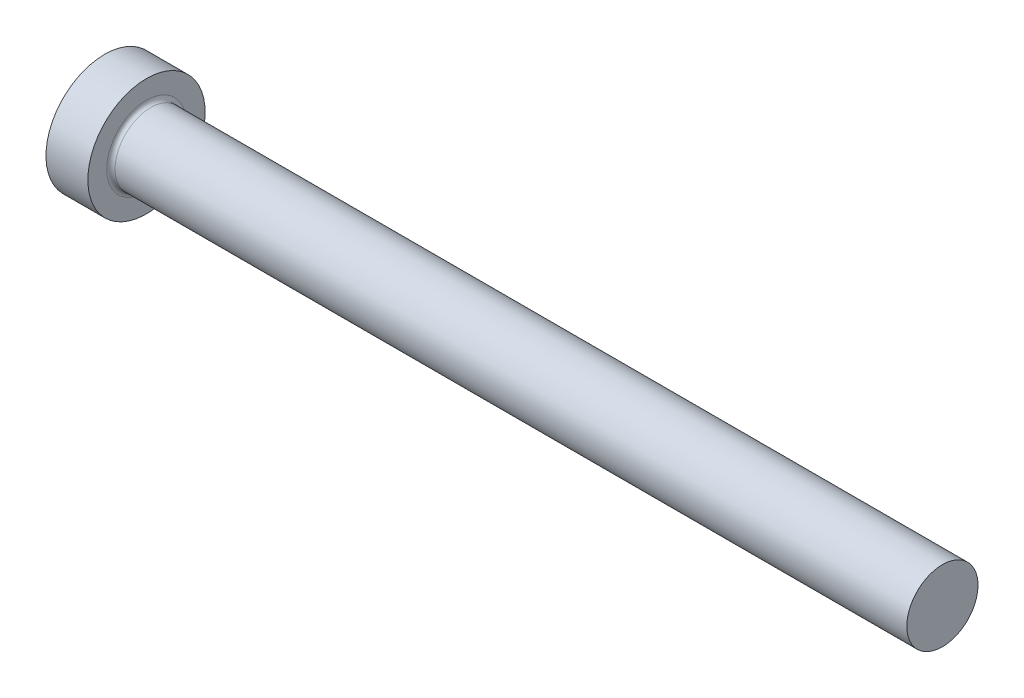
ISO-10303-21;
HEADER;
FILE_DESCRIPTION(('STEP AP214'),'2;1');
FILE_NAME('part.step','',(''),(''),'','','');
FILE_SCHEMA(('AUTOMOTIVE_DESIGN { 1 0 10303 214 1 1 1 1 }'));
ENDSEC;
DATA;
#1=APPLICATION_CONTEXT('core data for automotive mechanical design processes');
#2=APPLICATION_PROTOCOL_DEFINITION('international standard','automotive_design',2000,#1);
#3=PRODUCT_CONTEXT('',#1,'mechanical');
#4=PRODUCT('Part','Part','',(#3));
#5=PRODUCT_RELATED_PRODUCT_CATEGORY('part','',(#4));
#6=PRODUCT_DEFINITION_FORMATION('','',#4);
#7=PRODUCT_DEFINITION_CONTEXT('part definition',#1,'design');
#8=PRODUCT_DEFINITION('design','',#6,#7);
#9=PRODUCT_DEFINITION_SHAPE('','',#8);
#10=(LENGTH_UNIT() NAMED_UNIT(*) SI_UNIT(.MILLI.,.METRE.));
#11=(NAMED_UNIT(*) PLANE_ANGLE_UNIT() SI_UNIT($,.RADIAN.));
#12=(NAMED_UNIT(*) SI_UNIT($,.STERADIAN.) SOLID_ANGLE_UNIT());
#13=UNCERTAINTY_MEASURE_WITH_UNIT(LENGTH_MEASURE(1.E-05),#10,'distance_accuracy_value','');
#14=(GEOMETRIC_REPRESENTATION_CONTEXT(3) GLOBAL_UNCERTAINTY_ASSIGNED_CONTEXT((#13)) GLOBAL_UNIT_ASSIGNED_CONTEXT((#10,
#11,#12)) REPRESENTATION_CONTEXT('',''));
#15=CARTESIAN_POINT('',(0.,0.,0.));
#16=DIRECTION('',(0.,0.,1.));
#17=DIRECTION('',(1.,0.,0.));
#18=AXIS2_PLACEMENT_3D('',#15,#16,#17);
#19=CARTESIAN_POINT('',(0.,0.,0.));
#20=DIRECTION('',(-1.,0.,0.));
#21=DIRECTION('',(0.,-1.,0.));
#22=AXIS2_PLACEMENT_3D('',#19,#20,#21);
#23=PLANE('',#22);
#24=CARTESIAN_POINT('',(0.,0.,0.));
#25=DIRECTION('',(1.,0.,0.));
#26=DIRECTION('',(0.,1.,0.));
#27=AXIS2_PLACEMENT_3D('',#24,#25,#26);
#28=CIRCLE('',#27,7.);
#29=CARTESIAN_POINT('',(0.,7.,0.));
#30=VERTEX_POINT('',#29);
#31=EDGE_CURVE('E25',#30,#30,#28,.T.);
#32=ORIENTED_EDGE('',*,*,#31,.F.);
#33=EDGE_LOOP('',(#32));
#34=FACE_BOUND('',#33,.T.);
#35=ADVANCED_FACE('F14',(#34),#23,.T.);
#36=CARTESIAN_POINT('',(100.,0.,0.));
#37=DIRECTION('',(1.,0.,0.));
#38=DIRECTION('',(0.,1.,0.));
#39=AXIS2_PLACEMENT_3D('',#36,#37,#38);
#40=CYLINDRICAL_SURFACE('',#39,7.);
#41=ORIENTED_EDGE('',*,*,#31,.T.);
#42=EDGE_LOOP('',(#41));
#43=FACE_BOUND('',#42,.T.);
#44=CARTESIAN_POINT('',(5.,0.,0.));
#45=DIRECTION('',(1.,0.,0.));
#46=DIRECTION('',(0.,1.,0.));
#47=AXIS2_PLACEMENT_3D('',#44,#45,#46);
#48=CIRCLE('',#47,7.);
#49=CARTESIAN_POINT('',(5.,7.,0.));
#50=VERTEX_POINT('',#49);
#51=EDGE_CURVE('E29',#50,#50,#48,.T.);
#52=ORIENTED_EDGE('',*,*,#51,.F.);
#53=EDGE_LOOP('',(#52));
#54=FACE_BOUND('',#53,.T.);
#55=ADVANCED_FACE('F51',(#43,#54),#40,.T.);
#56=CARTESIAN_POINT('',(5.,7.,0.));
#57=DIRECTION('',(1.,0.,0.));
#58=DIRECTION('',(0.,1.,0.));
#59=AXIS2_PLACEMENT_3D('',#56,#57,#58);
#60=PLANE('',#59);
#61=CARTESIAN_POINT('',(5.,0.,0.));
#62=DIRECTION('',(1.,0.,0.));
#63=DIRECTION('',(0.,1.,0.));
#64=AXIS2_PLACEMENT_3D('',#61,#62,#63);
#65=CIRCLE('',#64,4.75);
#66=CARTESIAN_POINT('',(5.,4.75,0.));
#67=VERTEX_POINT('',#66);
#68=EDGE_CURVE('E9',#67,#67,#65,.F.);
#69=ORIENTED_EDGE('',*,*,#68,.T.);
#70=EDGE_LOOP('',(#69));
#71=FACE_BOUND('',#70,.T.);
#72=ORIENTED_EDGE('',*,*,#51,.T.);
#73=EDGE_LOOP('',(#72));
#74=FACE_BOUND('',#73,.T.);
#75=ADVANCED_FACE('F42',(#71,#74),#60,.T.);
#76=CARTESIAN_POINT('',(100.,0.,0.));
#77=DIRECTION('',(1.,0.,0.));
#78=DIRECTION('',(0.,1.,0.));
#79=AXIS2_PLACEMENT_3D('',#76,#77,#78);
#80=CYLINDRICAL_SURFACE('',#79,4.25);
#81=CARTESIAN_POINT('',(5.5,0.,0.));
#82=DIRECTION('',(1.,0.,0.));
#83=DIRECTION('',(0.,1.,0.));
#84=AXIS2_PLACEMENT_3D('',#81,#82,#83);
#85=CIRCLE('',#84,4.25);
#86=CARTESIAN_POINT('',(5.5,4.25,0.));
#87=VERTEX_POINT('',#86);
#88=EDGE_CURVE('E21',#87,#87,#85,.T.);
#89=ORIENTED_EDGE('',*,*,#88,.T.);
#90=EDGE_LOOP('',(#89));
#91=FACE_BOUND('',#90,.T.);
#92=CARTESIAN_POINT('',(100.,0.,0.));
#93=DIRECTION('',(1.,0.,0.));
#94=DIRECTION('',(0.,1.,0.));
#95=AXIS2_PLACEMENT_3D('',#92,#93,#94);
#96=CIRCLE('',#95,4.25);
#97=CARTESIAN_POINT('',(100.,4.24999999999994,0.));
#98=VERTEX_POINT('',#97);
#99=EDGE_CURVE('E34',#98,#98,#96,.T.);
#100=ORIENTED_EDGE('',*,*,#99,.F.);
#101=EDGE_LOOP('',(#100));
#102=FACE_BOUND('',#101,.T.);
#103=ADVANCED_FACE('F40',(#91,#102),#80,.T.);
#104=CARTESIAN_POINT('',(100.,4.24999999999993,0.));
#105=DIRECTION('',(1.,0.,0.));
#106=DIRECTION('',(0.,1.,0.));
#107=AXIS2_PLACEMENT_3D('',#104,#105,#106);
#108=PLANE('',#107);
#109=ORIENTED_EDGE('',*,*,#99,.T.);
#110=EDGE_LOOP('',(#109));
#111=FACE_BOUND('',#110,.T.);
#112=ADVANCED_FACE('F38',(#111),#108,.T.);
#113=CARTESIAN_POINT('',(5.5,0.,0.));
#114=DIRECTION('',(1.,0.,0.));
#115=DIRECTION('',(0.,1.,0.));
#116=AXIS2_PLACEMENT_3D('',#113,#114,#115);
#117=TOROIDAL_SURFACE('',#116,4.75,0.5);
#118=ORIENTED_EDGE('',*,*,#68,.F.);
#119=EDGE_LOOP('',(#118));
#120=FACE_BOUND('',#119,.T.);
#121=ORIENTED_EDGE('',*,*,#88,.F.);
#122=EDGE_LOOP('',(#121));
#123=FACE_BOUND('',#122,.T.);
#124=ADVANCED_FACE('F16',(#120,#123),#117,.F.);
#125=CLOSED_SHELL('',(#35,#55,#75,#103,#112,#124));
#126=MANIFOLD_SOLID_BREP('B1',#125);
#127=ADVANCED_BREP_SHAPE_REPRESENTATION('',(#18,#126),#14);
#128=SHAPE_DEFINITION_REPRESENTATION(#9,#127);
ENDSEC;
END-ISO-10303-21;
